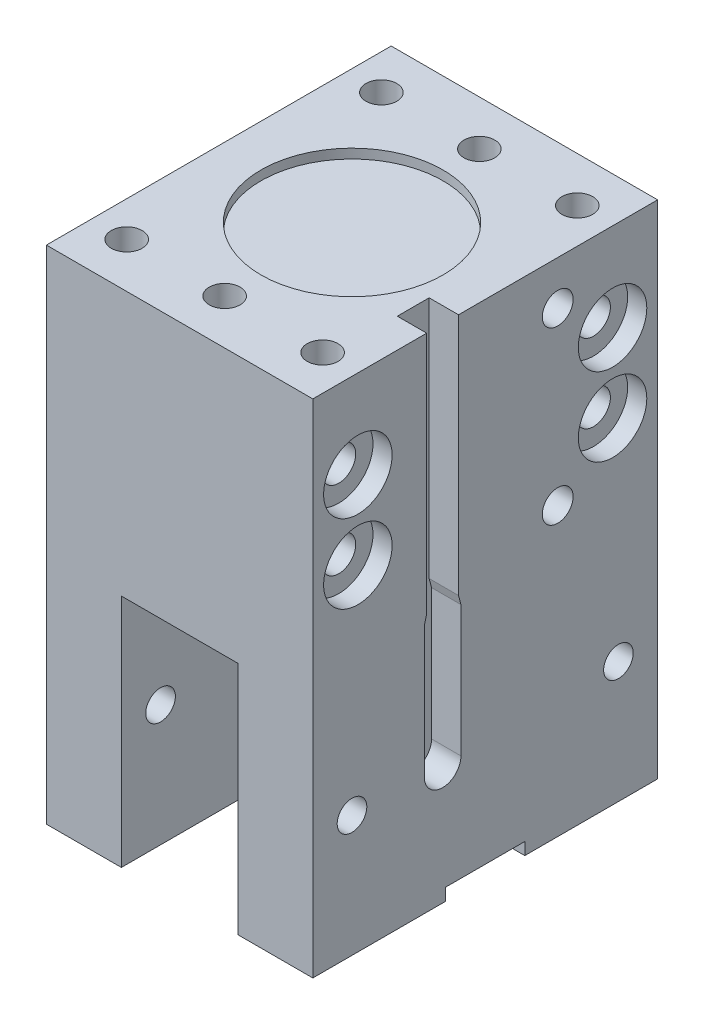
from build123d import *

# Parameters (mm, degrees)
SKETCH1_W                          = 43.18
SKETCH1_H                          = 55.88
EXTRUDE1_DEPTH                     = 40.64
M6_X_1_0_MOUNT_HOLES_D             = 5
M6_X_1_0_MOUNT_HOLES_DEPTH         = 9
M6_X_1_0_MOUNT_HOLES_TIP           = 1.502151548
SKETCH4_R                          = 2.5
F_5MM_DOWEL_HOLES_SLIP_FIT_DEPTH   = 8
SKETCH5_R                          = 14.75
CUT_EXTRUDE2_DEPTH                 = 1.524
M5X0_8_TAPPED_HOLE1_D              = 4.2
M5X0_8_TAPPED_HOLE1_DEPTH          = 13.6
M5X0_8_TAPPED_HOLE1_CBORE_D        = 5
M5X0_8_TAPPED_HOLE1_CBORE_DEPTH    = 9.6
M5X0_8_TAPPED_HOLE1_TIP            = 1.2618073
M6X1_0_MOUNT_HOLES_D               = 5
M6X1_0_MOUNT_HOLES_DEPTH           = 14
M6X1_0_MOUNT_HOLES_TIP             = 1.502151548
CBORE_FOR_M5_SHCS1_D               = 5.5
CBORE_FOR_M5_SHCS1_DEPTH           = 30.48
CBORE_FOR_M5_SHCS1_CBORE_D         = 11.1
CBORE_FOR_M5_SHCS1_CBORE_DEPTH     = 3.1
CBORE_FOR_M5_SHCS1_TIP             = 1.652366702
SKETCH12_R                         = 2.5
F_5MM_DOWEL_HOLES_SLIP_FIT_2_DEPTH = 6
SKETCH13_R                         = 2.4
CUT_EXTRUDE5_DEPTH                 = 66.549718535
CUT_EXTRUDE6_DEPTH                 = 4.7625
SKETCH15_W                         = 18.8722
SKETCH15_H                         = 38.1
CUT_EXTRUDE7_DEPTH                 = 73.39
SKETCH16_W                         = 12.827
SKETCH16_H                         = 1.984375
CUT_EXTRUDE8_DEPTH                 = 66.549718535
M8X1_25_TAPPED_HOLE1_D             = 6.8
M8X1_25_TAPPED_HOLE1_DEPTH         = 23
M8X1_25_TAPPED_HOLE1_TIP           = 2.042926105


with BuildPart() as part:
    # Sketch1 → Extrude1 (new, symmetric)
    with BuildSketch(Plane(origin=(0, 0, 0), x_dir=(1, 0, 0), z_dir=(0, 1, 0))):
        Rectangle(SKETCH1_W, SKETCH1_H)
    extrude(amount=EXTRUDE1_DEPTH, both=True)

    # M6 X 1.0 _Mount Holes
    with Locations(Plane(origin=(0, 40.64, 0), x_dir=(-1, 0, 0), z_dir=(0, 1, 0))):
        with Locations((-15.875, -20.6375), (-15.875, 20.6375), (15.875, 20.6375), (15.875, -20.6375)):
            Hole(M6_X_1_0_MOUNT_HOLES_D / 2, depth=M6_X_1_0_MOUNT_HOLES_DEPTH)
            with Locations((0, 0, -(M6_X_1_0_MOUNT_HOLES_DEPTH + M6_X_1_0_MOUNT_HOLES_TIP / 2))):  # 118° drill point
                Cone(0, M6_X_1_0_MOUNT_HOLES_D / 2, M6_X_1_0_MOUNT_HOLES_TIP, mode=Mode.SUBTRACT)

    # Sketch4 → 5MM Dowel Holes - Slip Fit (cut)
    with BuildSketch(Plane(origin=(0, 40.64, 0), x_dir=(-1, 0, 0), z_dir=(0, 1, 0))):
        with Locations(Location((0, 20.6375, 0), (0, 0, 90))):
            Circle(SKETCH4_R)
        with Locations(Location((0, -20.6375, 0), (0, 0, 90))):
            Circle(SKETCH4_R)
    extrude(amount=-F_5MM_DOWEL_HOLES_SLIP_FIT_DEPTH, mode=Mode.SUBTRACT)

    # Sketch5 → Cut-Extrude2 (cut)
    with BuildSketch(Plane(origin=(0, 40.64, 0), x_dir=(-1, 0, 0), z_dir=(0, 1, 0))):
        with Locations(Location((0, 0, 0), (0, 0, 90))):
            Circle(SKETCH5_R)
    extrude(amount=-CUT_EXTRUDE2_DEPTH, mode=Mode.SUBTRACT)

    # M5x0.8 Tapped Hole1
    with Locations(Plane(origin=(21.59, 0, 0), x_dir=(0, 0, -1), z_dir=(1, 0, 0))):
        with Locations((11.7475, 33.528), (11.7475, 5.842)):
            CounterBoreHole(M5X0_8_TAPPED_HOLE1_D / 2, M5X0_8_TAPPED_HOLE1_CBORE_D / 2, M5X0_8_TAPPED_HOLE1_CBORE_DEPTH, depth=M5X0_8_TAPPED_HOLE1_DEPTH)
            with Locations((0, 0, -(M5X0_8_TAPPED_HOLE1_DEPTH + M5X0_8_TAPPED_HOLE1_TIP / 2))):  # 118° drill point
                Cone(0, M5X0_8_TAPPED_HOLE1_D / 2, M5X0_8_TAPPED_HOLE1_TIP, mode=Mode.SUBTRACT)

    # M6X1.0 _Mount Holes
    with Locations(Plane.ZY.offset(21.59)):
        with Locations((-20.6375, 26.3525), (20.6375, 26.3525), (20.6375, 13.6525), (-20.6375, 13.6525)):
            Hole(M6X1_0_MOUNT_HOLES_D / 2, depth=M6X1_0_MOUNT_HOLES_DEPTH)
            with Locations((0, 0, -(M6X1_0_MOUNT_HOLES_DEPTH + M6X1_0_MOUNT_HOLES_TIP / 2))):  # 118° drill point
                Cone(0, M6X1_0_MOUNT_HOLES_D / 2, M6X1_0_MOUNT_HOLES_TIP, mode=Mode.SUBTRACT)

    # CBORE for M5 SHCS1
    with Locations(Plane(origin=(21.59, 26.3525, -20.6375), x_dir=(0, 0, 1), z_dir=(1, 0, 0))):
        with Locations((0, 0), (41.275, 12.7), (0, 12.7), (41.275, 0)):
            CounterBoreHole(CBORE_FOR_M5_SHCS1_D / 2, CBORE_FOR_M5_SHCS1_CBORE_D / 2, CBORE_FOR_M5_SHCS1_CBORE_DEPTH, depth=CBORE_FOR_M5_SHCS1_DEPTH)
            with Locations((0, 0, -(CBORE_FOR_M5_SHCS1_DEPTH + CBORE_FOR_M5_SHCS1_TIP / 2))):  # 118° drill point
                Cone(0, CBORE_FOR_M5_SHCS1_D / 2, CBORE_FOR_M5_SHCS1_TIP, mode=Mode.SUBTRACT)

    # Sketch12 → 5MM Dowel Holes - Slip Fit 2 (cut)
    with BuildSketch(Plane.ZY.offset(21.59)):
        with Locations((-20.6375, 20.0025)):
            Circle(SKETCH12_R)
        with Locations((20.6375, 20.0025)):
            Circle(SKETCH12_R)
    extrude(amount=-F_5MM_DOWEL_HOLES_SLIP_FIT_2_DEPTH, mode=Mode.SUBTRACT)

    # Sketch13 → Cut-Extrude5 (cut, through all)
    with BuildSketch(Plane(origin=(21.59, 0, 0), x_dir=(0, 0, -1), z_dir=(1, 0, 0))):
        with Locations((21.59, -20.9804)):
            Circle(SKETCH13_R)
        with Locations((-21.59, -20.9804)):
            Circle(SKETCH13_R)
    extrude(amount=-CUT_EXTRUDE5_DEPTH, mode=Mode.SUBTRACT)

    # Sketch14 → Cut-Extrude6 (cut)
    with BuildSketch(Plane(origin=(21.59, 0, 0), x_dir=(0, 0, -1), z_dir=(1, 0, 0))):
        with BuildLine():
            Line((-3.933825, -21.4709502), (-3.933825, -0.2380742))
            Line((-3.933825, -0.2380742), (-4.3259375, 1.246886))
            Line((-4.3259375, 1.246886), (-4.3259375, 40.64))
            Line((-4.3259375, 40.64), (-9.4853125, 40.64))
            Line((-9.4853125, 40.64), (-9.4853125, 1.246886))
            Line((-9.4853125, 1.246886), (-9.877425, -0.2380742))
            Line((-9.877425, -0.2380742), (-9.877425, -21.4709502))
            ThreePointArc((-9.877425, -21.4709502), (-6.905625, -24.4427502), (-3.933825, -21.4709502))
        make_face()
    extrude(amount=-CUT_EXTRUDE6_DEPTH, mode=Mode.SUBTRACT)

    # Sketch15 → Cut-Extrude7 (cut, through all)
    with BuildSketch(Plane.XY.offset(27.94)):
        with Locations((0, -21.59)):
            Rectangle(SKETCH15_W, SKETCH15_H)
    extrude(amount=-CUT_EXTRUDE7_DEPTH, mode=Mode.SUBTRACT)

    # Sketch16 → Cut-Extrude8 (cut, through all)
    with BuildSketch(Plane(origin=(21.59, 0, 0), x_dir=(0, 0, -1), z_dir=(1, 0, 0))):
        with Locations((0, -39.6478125)):
            Rectangle(SKETCH16_W, SKETCH16_H)
    extrude(amount=-CUT_EXTRUDE8_DEPTH, mode=Mode.SUBTRACT)

    # M8x1.25 Tapped Hole1
    with Locations(Plane.XZ.offset(38.655625)):
        with Locations((14.224, 0), (-14.224, 0)):
            Hole(M8X1_25_TAPPED_HOLE1_D / 2, depth=M8X1_25_TAPPED_HOLE1_DEPTH)
            with Locations((0, 0, -(M8X1_25_TAPPED_HOLE1_DEPTH + M8X1_25_TAPPED_HOLE1_TIP / 2))):  # 118° drill point
                Cone(0, M8X1_25_TAPPED_HOLE1_D / 2, M8X1_25_TAPPED_HOLE1_TIP, mode=Mode.SUBTRACT)


solid = part.part
